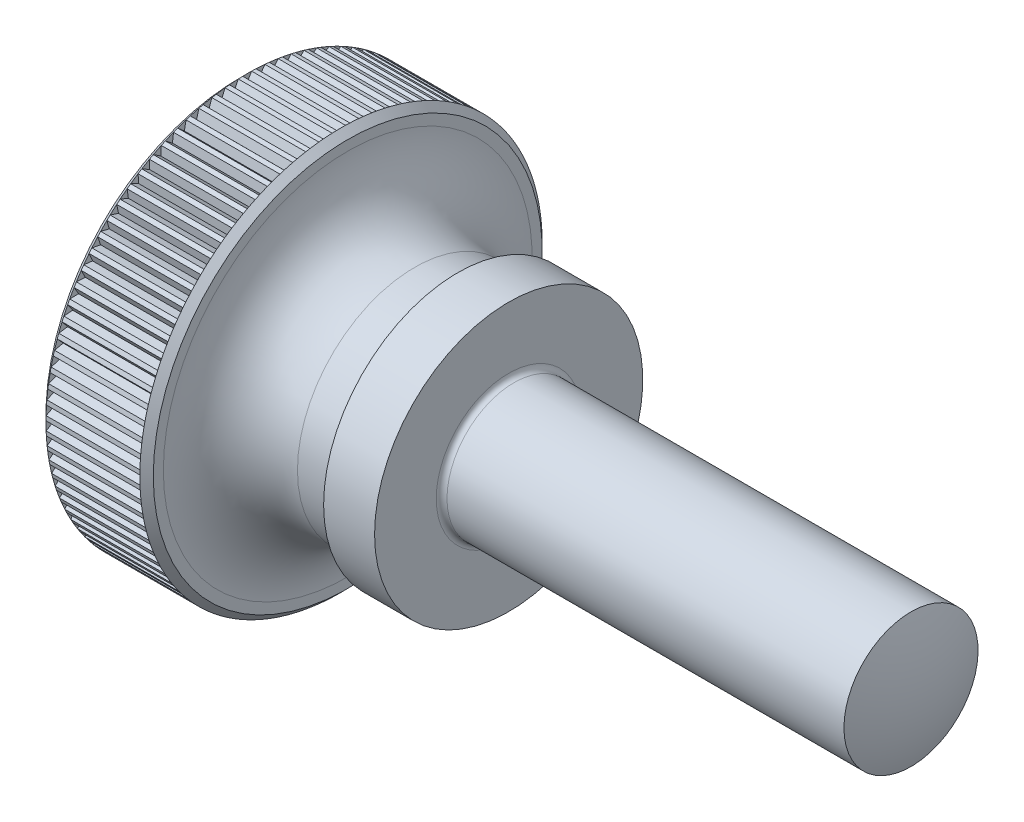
from build123d import *

# Parameters (mm, degrees)
FILLET1_R               = 5
CHAMFER1_SIZE           = 0.5
CUT_EXTRUDE1_DEPTH      = 7
CIRCULAR_PATTERN1_COUNT = 95
FILLET2_R               = 0.4


with BuildPart() as part:
    # Sketch1 → Base (revolve)
    with BuildSketch(Plane.XY, mode=Mode.PRIVATE) as base_sk:
        with BuildLine():
            Line((0, 0), (0, 15))
            Line((0, 15), (8, 15))
            Line((8, 15), (8, 8.75))
            Line((8, 8.75), (16.2, 8.75))
            Line((16.2, 8.75), (16.2, 10))
            Line((16.2, 10), (20, 10))
            Line((20, 10), (20, 5))
            Line((20, 5), (50, 5))
            ThreePointArc((50, 5), (50.690542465, 2.542267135), (50.923303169, 0))
            Line((50.923303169, 0), (0, 0))
        make_face()
    revolve(base_sk.sketch.rotate(Axis((-48.211075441, 0, 0), (1, 0, 0)), 90), axis=Axis((-48.211075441, 0, 0), (1, 0, 0)))

    # Fillet1
    fillet1_edges = [part.edges().sort_by_distance(p)[0] for p in [
        (8, 0, -8.75),
    ]]
    fillet(fillet1_edges, radius=FILLET1_R)

    # Chamfer1
    chamfer1_edges = [part.edges().sort_by_distance(p)[0] for p in [
        (0, 0, -15),
        (8, 0, -15),
    ]]
    chamfer(chamfer1_edges, length=CHAMFER1_SIZE)

    # Sketch2 → Cut-Extrude1 (cut)
    with BuildSketch(Plane(origin=(0.5, 0, 0), x_dir=(0, 0, -1), z_dir=(1, 0, 0))):
        Polygon((0, 14.422649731), (0.5, 15.288675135), (-0.5, 15.288675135), align=None)
    cut_extrude1 = extrude(amount=CUT_EXTRUDE1_DEPTH, mode=Mode.SUBTRACT)

    # Circular-Pattern1: Cut-Extrude1 ×95 about axis
    circular_pattern1_axis = Axis((0, 0, 0), (1, 0, 0))
    for i in range(1, CIRCULAR_PATTERN1_COUNT):
        add(cut_extrude1.rotate(circular_pattern1_axis, i * 360 / CIRCULAR_PATTERN1_COUNT), mode=Mode.SUBTRACT)

    # Fillet2
    fillet2_edges = [part.edges().sort_by_distance(p)[0] for p in [
        (20, 0, -5),
    ]]
    fillet(fillet2_edges, radius=FILLET2_R)


solid = part.part
